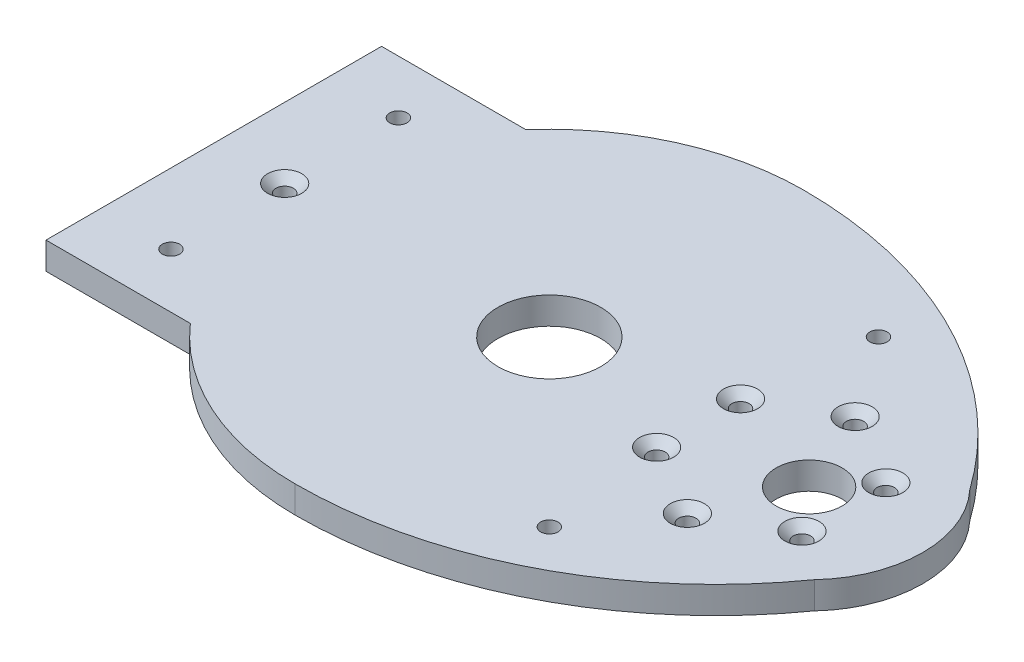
from build123d import *

# Parameters (mm, degrees)
SKETCH1_R                                           = 6.1
SKETCH1_R_2                                         = 9.5
BOSS_EXTRUDE1_DEPTH                                 = 5
CSK_FOR_M3_COUNTERSUNK_FLAT_HEAD_SCREW1_D           = 3.2
CSK_FOR_M3_COUNTERSUNK_FLAT_HEAD_SCREW1_DEPTH       = 9.5
CSK_FOR_M3_COUNTERSUNK_FLAT_HEAD_SCREW1_CSINK_D     = 6.3
CSK_FOR_M3_COUNTERSUNK_FLAT_HEAD_SCREW1_CSINK_ANGLE = 90
CSK_FOR_M3_COUNTERSUNK_FLAT_HEAD_SCREW1_TIP         = 0.96137699
CSK_FOR_M3_COUNTERSUNK_FLAT_HEAD_SCREW2_D           = 3.2
CSK_FOR_M3_COUNTERSUNK_FLAT_HEAD_SCREW2_CSINK_D     = 6.3
CSK_FOR_M3_COUNTERSUNK_FLAT_HEAD_SCREW2_CSINK_ANGLE = 90
SKETCH6_R                                           = 1.6
CUT_EXTRUDE2_DEPTH                                  = 84.6361166
CSK_FOR_M3_COUNTERSUNK_FLAT_HEAD_SCREW3_D           = 3.2
CSK_FOR_M3_COUNTERSUNK_FLAT_HEAD_SCREW3_CSINK_D     = 6.3
CSK_FOR_M3_COUNTERSUNK_FLAT_HEAD_SCREW3_CSINK_ANGLE = 90


with BuildPart() as part:
    # Sketch1 → Boss-Extrude1 (new body)
    with BuildSketch(Plane(origin=(0, 0, 0), x_dir=(1, 0, 0), z_dir=(0, 1, 0))):
        with BuildLine():
            Line((-35.327043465, 31), (-62, 31))
            Line((-62, 31), (-62, -31))
            Line((-62, -31), (-35.327043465, -31))
            ThreePointArc((-35.327043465, -31), (-19.39071943, -42.813549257), (0, -47))
            ThreePointArc((0, -47), (35.614793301, -38.36216221), (63.315219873, -14.368160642))
            ThreePointArc((63.315219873, -14.368160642), (69, 0), (63.315219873, 14.368160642))
            ThreePointArc((63.315219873, 14.368160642), (35.614793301, 38.36216221), (0, 47))
            ThreePointArc((0, 47), (-19.39071943, 42.813549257), (-35.327043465, 31))
        make_face()
        with Locations(Location((48, 0, 0), (0, 0, 270))):
            Circle(SKETCH1_R, mode=Mode.SUBTRACT)
        with Locations(Location((0, 0, 0), (0, 0, 270))):
            Circle(SKETCH1_R_2, mode=Mode.SUBTRACT)
    extrude(amount=BOSS_EXTRUDE1_DEPTH)

    # CSK for M3 Countersunk Flat Head Screw1
    with Locations(Plane(origin=(0, 5, 0), x_dir=(1, 0, 0), z_dir=(0, 1, 0))):
        with Locations((27.576606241, 7.75), (41, 15.5), (27.576606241, -7.75), (41, -15.5), (54.423393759, -7.75), (54.423393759, 7.75)):
            CounterSinkHole(CSK_FOR_M3_COUNTERSUNK_FLAT_HEAD_SCREW1_D / 2, CSK_FOR_M3_COUNTERSUNK_FLAT_HEAD_SCREW1_CSINK_D / 2, depth=CSK_FOR_M3_COUNTERSUNK_FLAT_HEAD_SCREW1_DEPTH, counter_sink_angle=CSK_FOR_M3_COUNTERSUNK_FLAT_HEAD_SCREW1_CSINK_ANGLE)
            with Locations((0, 0, -(CSK_FOR_M3_COUNTERSUNK_FLAT_HEAD_SCREW1_DEPTH + CSK_FOR_M3_COUNTERSUNK_FLAT_HEAD_SCREW1_TIP / 2))):  # 118° drill point
                Cone(0, CSK_FOR_M3_COUNTERSUNK_FLAT_HEAD_SCREW1_D / 2, CSK_FOR_M3_COUNTERSUNK_FLAT_HEAD_SCREW1_TIP, mode=Mode.SUBTRACT)

    # CSK for M3 Countersunk Flat Head Screw2 (through all)
    with Locations(Plane(origin=(0, 0, 0), x_dir=(-1, 0, 0), z_dir=(0, -1, 0))):
        with Locations((-30.405591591, -30.405591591), (-30.405591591, 30.405591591)):
            CounterSinkHole(CSK_FOR_M3_COUNTERSUNK_FLAT_HEAD_SCREW2_D / 2, CSK_FOR_M3_COUNTERSUNK_FLAT_HEAD_SCREW2_CSINK_D / 2, counter_sink_angle=CSK_FOR_M3_COUNTERSUNK_FLAT_HEAD_SCREW2_CSINK_ANGLE)

    # Sketch6 → Cut-Extrude2 (cut, through all)
    with BuildSketch(Plane.XZ):
        with Locations(Location((-49, -21.11, 0), (0, 0, 270))):
            Circle(SKETCH6_R)
        with Locations(Location((-49, 20.91, 0), (0, 0, 270))):
            Circle(SKETCH6_R)
        with Locations(Location((-49, -0.1, 0), (0, 0, 270))):
            Circle(SKETCH6_R)
    extrude(amount=-CUT_EXTRUDE2_DEPTH, mode=Mode.SUBTRACT)

    # CSK for M3 Countersunk Flat Head Screw3 (through all)
    with Locations(Plane(origin=(0, 5, 0), x_dir=(1, 0, 0), z_dir=(0, 1, 0))):
        with Locations((-49, 0.1)):
            CounterSinkHole(CSK_FOR_M3_COUNTERSUNK_FLAT_HEAD_SCREW3_D / 2, CSK_FOR_M3_COUNTERSUNK_FLAT_HEAD_SCREW3_CSINK_D / 2, counter_sink_angle=CSK_FOR_M3_COUNTERSUNK_FLAT_HEAD_SCREW3_CSINK_ANGLE)


solid = part.part
